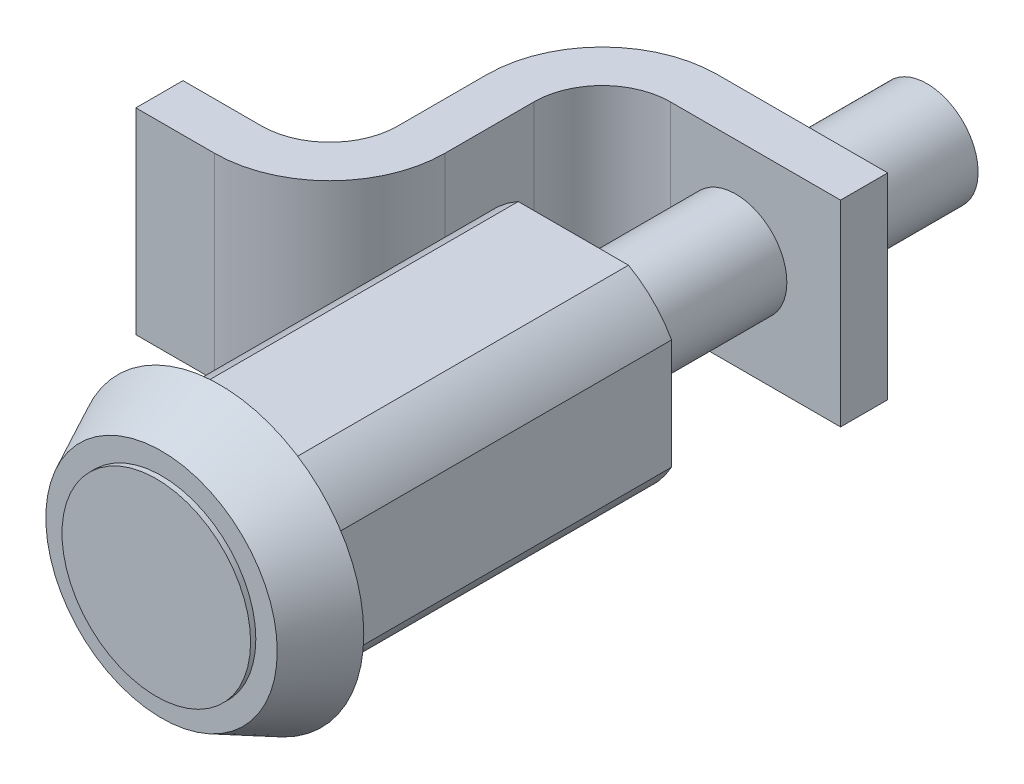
from build123d import *

# Parameters (mm, degrees)
SKETCH1_R                = 13.97
BOSS_EXTRUDE1_DEPTH      = 5.6388
DRAFT1_ANGLE             = -26
SKETCH2_R                = 9.144
BOSS_EXTRUDE2_DEPTH      = 0.508
BOSS_EXTRUDE3_DEPTH      = 34.29
SKETCH4_R                = 4.953
BOSS_EXTRUDE4_DEPTH      = 34.29
BOSS_EXTRUDE5_DEPTH      = 9.525
BOSS_EXTRUDE5_DEPTH_BACK = 9.525


with BuildPart() as part:
    # Sketch1 → Boss-Extrude1 (new body)
    with BuildSketch(Plane.XY):
        Circle(SKETCH1_R)
    extrude(amount=BOSS_EXTRUDE1_DEPTH)

    # Draft1
    draft1_faces = [part.faces().sort_by_distance(p)[0] for p in [
        (-13.97, 0, 2.8194),
    ]]
    draft(draft1_faces, Plane(origin=(0, 0, 0), x_dir=(-1, 0, 0), z_dir=(0, 0, -1)), DRAFT1_ANGLE)

    # Sketch2 → Boss-Extrude2 (add)
    with BuildSketch(Plane.XY.offset(5.6388)):
        Circle(SKETCH2_R)
    extrude(amount=BOSS_EXTRUDE2_DEPTH)

    # Sketch3 → Boss-Extrude3 (add)
    with BuildSketch(Plane(origin=(0, 0, 0), x_dir=(-1, 0, 0), z_dir=(0, 0, -1))):
        with BuildLine():
            Line((-5.344572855, 9.525), (5.344572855, 9.525))
            ThreePointArc((5.344572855, 9.525), (7.723020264, 7.723020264), (9.525, 5.344572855))
            Line((9.525, 5.344572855), (9.525, -5.344572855))
            ThreePointArc((9.525, -5.344572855), (7.723020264, -7.723020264), (5.344572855, -9.525))
            Line((5.344572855, -9.525), (-5.344572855, -9.525))
            ThreePointArc((-5.344572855, -9.525), (-7.723020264, -7.723020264), (-9.525, -5.344572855))
            Line((-9.525, -5.344572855), (-9.525, 5.344572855))
            ThreePointArc((-9.525, 5.344572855), (-7.723020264, 7.723020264), (-5.344572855, 9.525))
        make_face()
    extrude(amount=BOSS_EXTRUDE3_DEPTH)

    # Sketch4 → Boss-Extrude4 (add)
    with BuildSketch(Plane(origin=(0, 0, -34.29), x_dir=(-1, 0, 0), z_dir=(0, 0, -1))):
        Circle(SKETCH4_R)
    extrude(amount=BOSS_EXTRUDE4_DEPTH)

    # Sketch6 → Boss-Extrude5 (add, two sides: drawn at the far end of the back side and taken through both)
    with BuildSketch(Plane(origin=(0, 0, 0), x_dir=(1, 0, 0), z_dir=(0, 1, 0)).offset(-BOSS_EXTRUDE5_DEPTH_BACK)):
        with BuildLine():
            Line((10.16, 54.61), (10.16, 50.038))
            Line((10.16, 50.038), (-6.35, 50.038))
            ThreePointArc((-6.35, 50.038), (-11.019733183, 48.103733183), (-12.954, 43.434))
            Line((-12.954, 43.434), (-12.954, 34.798))
            ThreePointArc((-12.954, 34.798), (-16.227374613, 26.895374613), (-24.13, 23.622))
            Line((-24.13, 23.622), (-31.75, 23.622))
            Line((-31.75, 23.622), (-31.75, 28.194))
            Line((-31.75, 28.194), (-24.13, 28.194))
            ThreePointArc((-24.13, 28.194), (-19.460266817, 30.128266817), (-17.526, 34.798))
            Line((-17.526, 34.798), (-17.526, 43.434))
            ThreePointArc((-17.526, 43.434), (-14.252625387, 51.336625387), (-6.35, 54.61))
            Line((-6.35, 54.61), (10.16, 54.61))
        make_face()
    extrude(amount=BOSS_EXTRUDE5_DEPTH + BOSS_EXTRUDE5_DEPTH_BACK)


solid = part.part
